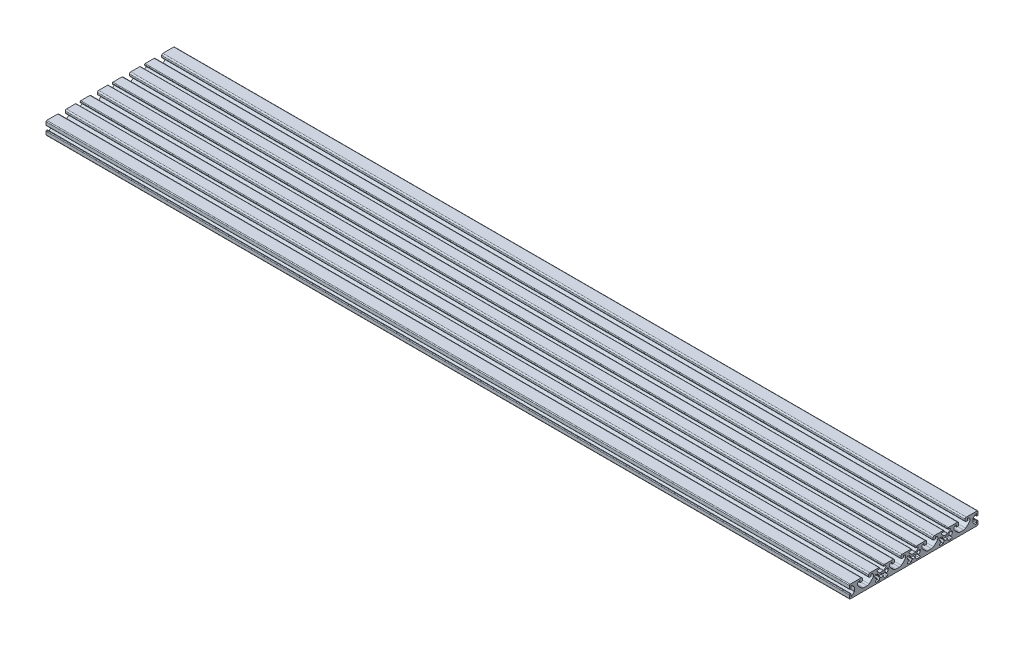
from build123d import *

# Parameters (mm, degrees)
STRUKTURBAUTEIL1_DEPTH = 1000


with BuildPart() as part:
    # Model → Strukturbauteil1 (new body)
    with BuildSketch(Plane(origin=(0, 0, 0), x_dir=(0, 0, -1), z_dir=(1, 0, 0))):
        with BuildLine():
            Line((50, 2.720360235), (50, 3.5))
            ThreePointArc((50, 3.5), (50.732233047, 5.267766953), (52.5, 6))
            ThreePointArc((52.5, 6), (52.853553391, 5.853553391), (53, 5.5))
            Line((53, 5.5), (53, 4))
            ThreePointArc((53, 4), (53.146446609, 3.646446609), (53.5, 3.5))
            Line((53.5, 3.5), (55, 3.5))
            ThreePointArc((55, 3.5), (55.707106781, 3.792893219), (56, 4.5))
            Line((56, 4.5), (56, 6.5))
            ThreePointArc((56, 6.5), (55.560660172, 7.560660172), (54.5, 8))
            Line((54.5, 8), (43.3, 8))
            ThreePointArc((43.3, 8), (42.734314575, 7.765685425), (42.5, 7.2))
            Line((42.5, 7.2), (42.5, 6.5))
            ThreePointArc((42.5, 6.5), (42.587867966, 6.287867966), (42.8, 6.2))
            Line((42.8, 6.2), (44.95, 6.2))
            ThreePointArc((44.95, 6.2), (45.689103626, 5.706146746), (45.515685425, 4.834314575))
            Line((45.515685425, 4.834314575), (42.715685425, 2.034314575))
            ThreePointArc((42.715685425, 2.034314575), (42.456146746, 1.860896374), (42.15, 1.8))
            Line((42.15, 1.8), (37.85, 1.8))
            ThreePointArc((37.85, 1.8), (37.543853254, 1.860896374), (37.284314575, 2.034314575))
            Line((37.284314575, 2.034314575), (34.484314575, 4.834314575))
            ThreePointArc((34.484314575, 4.834314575), (34.310896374, 5.706146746), (35.05, 6.2))
            Line((35.05, 6.2), (37.2, 6.2))
            ThreePointArc((37.2, 6.2), (37.412132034, 6.287867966), (37.5, 6.5))
            Line((37.5, 6.5), (37.5, 7.2))
            ThreePointArc((37.5, 7.2), (37.265685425, 7.765685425), (36.7, 8))
            Line((36.7, 8), (25.5, 8))
            ThreePointArc((25.5, 8), (24.439339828, 7.560660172), (24, 6.5))
            Line((24, 6.5), (24, 4.5))
            ThreePointArc((24, 4.5), (24.292893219, 3.792893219), (25, 3.5))
            Line((25, 3.5), (26.5, 3.5))
            ThreePointArc((26.5, 3.5), (26.853553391, 3.646446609), (27, 4))
            Line((27, 4), (27, 5.5))
            ThreePointArc((27, 5.5), (27.146446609, 5.853553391), (27.5, 6))
            ThreePointArc((27.5, 6), (29.267766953, 5.267766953), (30, 3.5))
            Line((30, 3.5), (30, 2.720360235))
            ThreePointArc((30, 2.720360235), (29.895991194, 2.083793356), (29.594782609, 1.513435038))
            ThreePointArc((29.594782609, 1.513435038), (27.264029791, -1.151003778), (24.580305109, -3.45952381))
            ThreePointArc((24.580305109, -3.45952381), (23.45041558, -4.047242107), (22.193056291, -4.25))
            Line((22.193056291, -4.25), (20, -4.25))
            Line((20, -4.25), (17.806943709, -4.25))
            ThreePointArc((17.806943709, -4.25), (16.54958442, -4.047242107), (15.419694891, -3.45952381))
            ThreePointArc((15.419694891, -3.45952381), (12.735970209, -1.151003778), (10.405217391, 1.513435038))
            ThreePointArc((10.405217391, 1.513435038), (10.104008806, 2.083793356), (10, 2.720360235))
            Line((10, 2.720360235), (10, 3.5))
            ThreePointArc((10, 3.5), (10.732233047, 5.267766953), (12.5, 6))
            ThreePointArc((12.5, 6), (12.853553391, 5.853553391), (13, 5.5))
            Line((13, 5.5), (13, 4))
            ThreePointArc((13, 4), (13.146446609, 3.646446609), (13.5, 3.5))
            Line((13.5, 3.5), (15, 3.5))
            ThreePointArc((15, 3.5), (15.707106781, 3.792893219), (16, 4.5))
            Line((16, 4.5), (16, 6.5))
            ThreePointArc((16, 6.5), (15.560660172, 7.560660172), (14.5, 8))
            Line((14.5, 8), (3.3, 8))
            ThreePointArc((3.3, 8), (2.734314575, 7.765685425), (2.5, 7.2))
            Line((2.5, 7.2), (2.5, 6.5))
            ThreePointArc((2.5, 6.5), (2.587867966, 6.287867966), (2.8, 6.2))
            Line((2.8, 6.2), (4.95, 6.2))
            ThreePointArc((4.95, 6.2), (5.689103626, 5.706146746), (5.515685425, 4.834314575))
            Line((5.515685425, 4.834314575), (2.715685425, 2.034314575))
            ThreePointArc((2.715685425, 2.034314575), (2.456146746, 1.860896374), (2.15, 1.8))
            Line((2.15, 1.8), (-2.15, 1.8))
            ThreePointArc((-2.15, 1.8), (-2.456146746, 1.860896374), (-2.715685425, 2.034314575))
            Line((-2.715685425, 2.034314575), (-5.515685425, 4.834314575))
            ThreePointArc((-5.515685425, 4.834314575), (-5.689103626, 5.706146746), (-4.95, 6.2))
            Line((-4.95, 6.2), (-2.8, 6.2))
            ThreePointArc((-2.8, 6.2), (-2.587867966, 6.287867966), (-2.5, 6.5))
            Line((-2.5, 6.5), (-2.5, 7.2))
            ThreePointArc((-2.5, 7.2), (-2.734314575, 7.765685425), (-3.3, 8))
            Line((-3.3, 8), (-14.5, 8))
            ThreePointArc((-14.5, 8), (-15.560660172, 7.560660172), (-16, 6.5))
            Line((-16, 6.5), (-16, 4.5))
            ThreePointArc((-16, 4.5), (-15.707106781, 3.792893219), (-15, 3.5))
            Line((-15, 3.5), (-13.5, 3.5))
            ThreePointArc((-13.5, 3.5), (-13.146446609, 3.646446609), (-13, 4))
            Line((-13, 4), (-13, 5.5))
            ThreePointArc((-13, 5.5), (-12.853553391, 5.853553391), (-12.5, 6))
            ThreePointArc((-12.5, 6), (-10.732233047, 5.267766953), (-10, 3.5))
            Line((-10, 3.5), (-10, 2.720360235))
            ThreePointArc((-10, 2.720360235), (-10.104008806, 2.083793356), (-10.405217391, 1.513435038))
            ThreePointArc((-10.405217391, 1.513435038), (-12.735970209, -1.151003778), (-15.419694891, -3.45952381))
            ThreePointArc((-15.419694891, -3.45952381), (-16.54958442, -4.047242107), (-17.806943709, -4.25))
            Line((-17.806943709, -4.25), (-20, -4.25))
            Line((-20, -4.25), (-22.193056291, -4.25))
            ThreePointArc((-22.193056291, -4.25), (-23.45041558, -4.047242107), (-24.580305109, -3.45952381))
            ThreePointArc((-24.580305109, -3.45952381), (-27.264029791, -1.151003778), (-29.594782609, 1.513435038))
            ThreePointArc((-29.594782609, 1.513435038), (-29.895991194, 2.083793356), (-30, 2.720360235))
            Line((-30, 2.720360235), (-30, 3.5))
            ThreePointArc((-30, 3.5), (-29.267766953, 5.267766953), (-27.5, 6))
            ThreePointArc((-27.5, 6), (-27.146446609, 5.853553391), (-27, 5.5))
            Line((-27, 5.5), (-27, 4))
            ThreePointArc((-27, 4), (-26.853553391, 3.646446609), (-26.5, 3.5))
            Line((-26.5, 3.5), (-25, 3.5))
            ThreePointArc((-25, 3.5), (-24.292893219, 3.792893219), (-24, 4.5))
            Line((-24, 4.5), (-24, 6.5))
            ThreePointArc((-24, 6.5), (-24.439339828, 7.560660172), (-25.5, 8))
            Line((-25.5, 8), (-36.7, 8))
            ThreePointArc((-36.7, 8), (-37.265685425, 7.765685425), (-37.5, 7.2))
            Line((-37.5, 7.2), (-37.5, 6.5))
            ThreePointArc((-37.5, 6.5), (-37.412132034, 6.287867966), (-37.2, 6.2))
            Line((-37.2, 6.2), (-35.05, 6.2))
            ThreePointArc((-35.05, 6.2), (-34.310896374, 5.706146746), (-34.484314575, 4.834314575))
            Line((-34.484314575, 4.834314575), (-37.284314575, 2.034314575))
            ThreePointArc((-37.284314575, 2.034314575), (-37.543853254, 1.860896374), (-37.85, 1.8))
            Line((-37.85, 1.8), (-42.15, 1.8))
            ThreePointArc((-42.15, 1.8), (-42.456146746, 1.860896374), (-42.715685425, 2.034314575))
            Line((-42.715685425, 2.034314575), (-45.515685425, 4.834314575))
            ThreePointArc((-45.515685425, 4.834314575), (-45.689103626, 5.706146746), (-44.95, 6.2))
            Line((-44.95, 6.2), (-42.8, 6.2))
            ThreePointArc((-42.8, 6.2), (-42.587867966, 6.287867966), (-42.5, 6.5))
            Line((-42.5, 6.5), (-42.5, 7.2))
            ThreePointArc((-42.5, 7.2), (-42.734314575, 7.765685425), (-43.3, 8))
            Line((-43.3, 8), (-54.5, 8))
            ThreePointArc((-54.5, 8), (-55.560660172, 7.560660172), (-56, 6.5))
            Line((-56, 6.5), (-56, 4.5))
            ThreePointArc((-56, 4.5), (-55.707106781, 3.792893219), (-55, 3.5))
            Line((-55, 3.5), (-53.5, 3.5))
            ThreePointArc((-53.5, 3.5), (-53.146446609, 3.646446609), (-53, 4))
            Line((-53, 4), (-53, 5.5))
            ThreePointArc((-53, 5.5), (-52.853553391, 5.853553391), (-52.5, 6))
            ThreePointArc((-52.5, 6), (-50.732233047, 5.267766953), (-50, 3.5))
            Line((-50, 3.5), (-50, 2.720360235))
            ThreePointArc((-50, 2.720360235), (-50.104008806, 2.083793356), (-50.405217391, 1.513435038))
            ThreePointArc((-50.405217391, 1.513435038), (-52.735970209, -1.151003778), (-55.419694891, -3.45952381))
            ThreePointArc((-55.419694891, -3.45952381), (-56.54958442, -4.047242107), (-57.806943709, -4.25))
            Line((-57.806943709, -4.25), (-60, -4.25))
            Line((-60, -4.25), (-62.193056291, -4.25))
            ThreePointArc((-62.193056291, -4.25), (-63.45041558, -4.047242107), (-64.580305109, -3.45952381))
            ThreePointArc((-64.580305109, -3.45952381), (-67.264029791, -1.151003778), (-69.594782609, 1.513435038))
            ThreePointArc((-69.594782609, 1.513435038), (-69.895991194, 2.083793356), (-70, 2.720360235))
            Line((-70, 2.720360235), (-70, 3.5))
            ThreePointArc((-70, 3.5), (-69.267766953, 5.267766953), (-67.5, 6))
            ThreePointArc((-67.5, 6), (-67.146446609, 5.853553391), (-67, 5.5))
            Line((-67, 5.5), (-67, 4))
            ThreePointArc((-67, 4), (-66.853553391, 3.646446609), (-66.5, 3.5))
            Line((-66.5, 3.5), (-65, 3.5))
            ThreePointArc((-65, 3.5), (-64.292893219, 3.792893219), (-64, 4.5))
            Line((-64, 4.5), (-64, 6.5))
            ThreePointArc((-64, 6.5), (-64.439339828, 7.560660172), (-65.5, 8))
            Line((-65.5, 8), (-79, 8))
            ThreePointArc((-79, 8), (-79.707106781, 7.707106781), (-80, 7))
            Line((-80, 7), (-80, 3.3))
            ThreePointArc((-80, 3.3), (-79.765685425, 2.734314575), (-79.2, 2.5))
            Line((-79.2, 2.5), (-78.5, 2.5))
            ThreePointArc((-78.5, 2.5), (-78.287867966, 2.587867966), (-78.2, 2.8))
            Line((-78.2, 2.8), (-78.2, 4.95))
            ThreePointArc((-78.2, 4.95), (-77.706146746, 5.689103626), (-76.834314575, 5.515685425))
            Line((-76.834314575, 5.515685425), (-74.034314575, 2.715685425))
            ThreePointArc((-74.034314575, 2.715685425), (-73.860896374, 2.456146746), (-73.8, 2.15))
            Line((-73.8, 2.15), (-73.8, -2.15))
            ThreePointArc((-73.8, -2.15), (-73.860896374, -2.456146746), (-74.034314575, -2.715685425))
            Line((-74.034314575, -2.715685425), (-76.834314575, -5.515685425))
            ThreePointArc((-76.834314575, -5.515685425), (-77.706146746, -5.689103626), (-78.2, -4.95))
            Line((-78.2, -4.95), (-78.2, -2.8))
            ThreePointArc((-78.2, -2.8), (-78.287867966, -2.587867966), (-78.5, -2.5))
            Line((-78.5, -2.5), (-79.2, -2.5))
            ThreePointArc((-79.2, -2.5), (-79.765685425, -2.734314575), (-80, -3.3))
            Line((-80, -3.3), (-80, -7))
            ThreePointArc((-80, -7), (-79.707106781, -7.707106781), (-79, -8))
            Line((-79, -8), (79, -8))
            ThreePointArc((79, -8), (79.707106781, -7.707106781), (80, -7))
            Line((80, -7), (80, -3.3))
            ThreePointArc((80, -3.3), (79.765685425, -2.734314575), (79.2, -2.5))
            Line((79.2, -2.5), (78.5, -2.5))
            ThreePointArc((78.5, -2.5), (78.287867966, -2.587867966), (78.2, -2.8))
            Line((78.2, -2.8), (78.2, -4.95))
            ThreePointArc((78.2, -4.95), (77.706146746, -5.689103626), (76.834314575, -5.515685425))
            Line((76.834314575, -5.515685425), (74.034314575, -2.715685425))
            ThreePointArc((74.034314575, -2.715685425), (73.860896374, -2.456146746), (73.8, -2.15))
            Line((73.8, -2.15), (73.8, 2.15))
            ThreePointArc((73.8, 2.15), (73.860896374, 2.456146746), (74.034314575, 2.715685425))
            Line((74.034314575, 2.715685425), (76.834314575, 5.515685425))
            ThreePointArc((76.834314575, 5.515685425), (77.706146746, 5.689103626), (78.2, 4.95))
            Line((78.2, 4.95), (78.2, 2.8))
            ThreePointArc((78.2, 2.8), (78.287867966, 2.587867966), (78.5, 2.5))
            Line((78.5, 2.5), (79.2, 2.5))
            ThreePointArc((79.2, 2.5), (79.765685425, 2.734314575), (80, 3.3))
            Line((80, 3.3), (80, 7))
            ThreePointArc((80, 7), (79.707106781, 7.707106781), (79, 8))
            Line((79, 8), (65.5, 8))
            ThreePointArc((65.5, 8), (64.439339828, 7.560660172), (64, 6.5))
            Line((64, 6.5), (64, 4.5))
            ThreePointArc((64, 4.5), (64.292893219, 3.792893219), (65, 3.5))
            Line((65, 3.5), (66.5, 3.5))
            ThreePointArc((66.5, 3.5), (66.853553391, 3.646446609), (67, 4))
            Line((67, 4), (67, 5.5))
            ThreePointArc((67, 5.5), (67.146446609, 5.853553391), (67.5, 6))
            ThreePointArc((67.5, 6), (69.267766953, 5.267766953), (70, 3.5))
            Line((70, 3.5), (70, 2.720360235))
            ThreePointArc((70, 2.720360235), (69.895991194, 2.083793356), (69.594782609, 1.513435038))
            ThreePointArc((69.594782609, 1.513435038), (67.264029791, -1.151003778), (64.580305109, -3.45952381))
            ThreePointArc((64.580305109, -3.45952381), (63.45041558, -4.047242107), (62.193056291, -4.25))
            Line((62.193056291, -4.25), (60, -4.25))
            Line((60, -4.25), (57.806943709, -4.25))
            ThreePointArc((57.806943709, -4.25), (56.54958442, -4.047242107), (55.419694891, -3.45952381))
            ThreePointArc((55.419694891, -3.45952381), (52.735970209, -1.151003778), (50.405217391, 1.513435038))
            ThreePointArc((50.405217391, 1.513435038), (50.104008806, 2.083793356), (50, 2.720360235))
        make_face()
        with BuildLine():
            Line((-48.474873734, 1.060660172), (-47.931851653, 0.51763809))
            ThreePointArc((-47.931851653, 0.51763809), (-47.586706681, -1.217522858), (-46, -2))
            Line((-46, -2), (-46, -3))
            Line((-46, -3), (-47.492893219, -4.492893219))
            ThreePointArc((-47.492893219, -4.492893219), (-47.70966597, -5.582683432), (-46.785786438, -6.2))
            Line((-46.785786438, -6.2), (-43, -6.2))
            Line((-43, -6.2), (-42.197898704, -3.206517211))
            ThreePointArc((-42.197898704, -3.206517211), (-41.957481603, -2.988251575), (-41.659235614, -3.116663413))
            ThreePointArc((-41.659235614, -3.116663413), (-40, -4), (-38.340764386, -3.116663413))
            ThreePointArc((-38.340764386, -3.116663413), (-38.042518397, -2.988251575), (-37.802101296, -3.206517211))
            Line((-37.802101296, -3.206517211), (-37, -6.2))
            Line((-37, -6.2), (-33.214213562, -6.2))
            ThreePointArc((-33.214213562, -6.2), (-32.29033403, -5.582683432), (-32.507106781, -4.492893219))
            Line((-32.507106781, -4.492893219), (-34, -3))
            Line((-34, -3), (-34, -2))
            ThreePointArc((-34, -2), (-32.413293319, -1.217522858), (-32.068148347, 0.51763809))
            Line((-32.068148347, 0.51763809), (-31.525126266, 1.060660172))
            ThreePointArc((-31.525126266, 1.060660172), (-31.466547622, 1.202081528), (-31.525126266, 1.343502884))
            Line((-31.525126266, 1.343502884), (-32.656497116, 2.474873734))
            ThreePointArc((-32.656497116, 2.474873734), (-32.797918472, 2.533452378), (-32.939339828, 2.474873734))
            Line((-32.939339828, 2.474873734), (-33.48236191, 1.931851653))
            ThreePointArc((-33.48236191, 1.931851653), (-35.414211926, 1.414215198), (-35.93185285, -0.517633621))
            Line((-35.93185285, -0.517633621), (-36.41421783, -1))
            Line((-36.41421783, -1), (-38.267949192, -1))
            ThreePointArc((-38.267949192, -1), (-40, 0), (-41.732050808, -1))
            Line((-41.732050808, -1), (-43.58578217, -1))
            Line((-43.58578217, -1), (-44.06814715, -0.517633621))
            ThreePointArc((-44.06814715, -0.517633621), (-44.585788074, 1.414215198), (-46.51763809, 1.931851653))
            Line((-46.51763809, 1.931851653), (-47.060660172, 2.474873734))
            ThreePointArc((-47.060660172, 2.474873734), (-47.202081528, 2.533452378), (-47.343502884, 2.474873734))
            Line((-47.343502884, 2.474873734), (-48.474873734, 1.343502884))
            ThreePointArc((-48.474873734, 1.343502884), (-48.533452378, 1.202081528), (-48.474873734, 1.060660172))
        make_face(mode=Mode.SUBTRACT)
        with BuildLine():
            Line((-6, -2), (-6, -3))
            Line((-6, -3), (-7.492893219, -4.492893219))
            ThreePointArc((-7.492893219, -4.492893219), (-7.70966597, -5.582683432), (-6.785786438, -6.2))
            Line((-6.785786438, -6.2), (-3, -6.2))
            Line((-3, -6.2), (-2.197898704, -3.206517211))
            ThreePointArc((-2.197898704, -3.206517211), (-1.957481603, -2.988251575), (-1.659235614, -3.116663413))
            ThreePointArc((-1.659235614, -3.116663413), (0, -4), (1.659235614, -3.116663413))
            ThreePointArc((1.659235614, -3.116663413), (1.957481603, -2.988251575), (2.197898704, -3.206517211))
            Line((2.197898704, -3.206517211), (3, -6.2))
            Line((3, -6.2), (6.785786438, -6.2))
            ThreePointArc((6.785786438, -6.2), (7.70966597, -5.582683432), (7.492893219, -4.492893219))
            Line((7.492893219, -4.492893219), (6, -3))
            Line((6, -3), (6, -2))
            ThreePointArc((6, -2), (7.586706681, -1.217522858), (7.931851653, 0.51763809))
            Line((7.931851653, 0.51763809), (8.474873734, 1.060660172))
            ThreePointArc((8.474873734, 1.060660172), (8.533452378, 1.202081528), (8.474873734, 1.343502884))
            Line((8.474873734, 1.343502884), (7.343502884, 2.474873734))
            ThreePointArc((7.343502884, 2.474873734), (7.202081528, 2.533452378), (7.060660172, 2.474873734))
            Line((7.060660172, 2.474873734), (6.51763809, 1.931851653))
            ThreePointArc((6.51763809, 1.931851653), (4.585788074, 1.414215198), (4.06814715, -0.517633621))
            Line((4.06814715, -0.517633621), (3.58578217, -1))
            Line((3.58578217, -1), (1.732050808, -1))
            ThreePointArc((1.732050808, -1), (0, 0), (-1.732050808, -1))
            Line((-1.732050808, -1), (-3.58578217, -1))
            Line((-3.58578217, -1), (-4.06814715, -0.517633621))
            ThreePointArc((-4.06814715, -0.517633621), (-4.585788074, 1.414215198), (-6.51763809, 1.931851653))
            Line((-6.51763809, 1.931851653), (-7.060660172, 2.474873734))
            ThreePointArc((-7.060660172, 2.474873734), (-7.202081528, 2.533452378), (-7.343502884, 2.474873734))
            Line((-7.343502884, 2.474873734), (-8.474873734, 1.343502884))
            ThreePointArc((-8.474873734, 1.343502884), (-8.533452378, 1.202081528), (-8.474873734, 1.060660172))
            Line((-8.474873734, 1.060660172), (-7.931851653, 0.51763809))
            ThreePointArc((-7.931851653, 0.51763809), (-7.586706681, -1.217522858), (-6, -2))
        make_face(mode=Mode.SUBTRACT)
        with BuildLine():
            Line((34, -2), (34, -3))
            Line((34, -3), (32.507106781, -4.492893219))
            ThreePointArc((32.507106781, -4.492893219), (32.29033403, -5.582683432), (33.214213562, -6.2))
            Line((33.214213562, -6.2), (37, -6.2))
            Line((37, -6.2), (37.802101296, -3.206517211))
            ThreePointArc((37.802101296, -3.206517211), (38.042518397, -2.988251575), (38.340764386, -3.116663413))
            ThreePointArc((38.340764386, -3.116663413), (40, -4), (41.659235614, -3.116663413))
            ThreePointArc((41.659235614, -3.116663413), (41.957481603, -2.988251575), (42.197898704, -3.206517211))
            Line((42.197898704, -3.206517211), (43, -6.2))
            Line((43, -6.2), (46.785786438, -6.2))
            ThreePointArc((46.785786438, -6.2), (47.70966597, -5.582683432), (47.492893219, -4.492893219))
            Line((47.492893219, -4.492893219), (46, -3))
            Line((46, -3), (46, -2))
            ThreePointArc((46, -2), (47.586706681, -1.217522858), (47.931851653, 0.51763809))
            Line((47.931851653, 0.51763809), (48.474873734, 1.060660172))
            ThreePointArc((48.474873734, 1.060660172), (48.533452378, 1.202081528), (48.474873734, 1.343502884))
            Line((48.474873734, 1.343502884), (47.343502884, 2.474873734))
            ThreePointArc((47.343502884, 2.474873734), (47.202081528, 2.533452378), (47.060660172, 2.474873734))
            Line((47.060660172, 2.474873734), (46.51763809, 1.931851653))
            ThreePointArc((46.51763809, 1.931851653), (44.585788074, 1.414215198), (44.06814715, -0.517633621))
            Line((44.06814715, -0.517633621), (43.58578217, -1))
            Line((43.58578217, -1), (41.732050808, -1))
            ThreePointArc((41.732050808, -1), (40, 0), (38.267949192, -1))
            Line((38.267949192, -1), (36.41421783, -1))
            Line((36.41421783, -1), (35.93185285, -0.517633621))
            ThreePointArc((35.93185285, -0.517633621), (35.414211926, 1.414215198), (33.48236191, 1.931851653))
            Line((33.48236191, 1.931851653), (32.939339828, 2.474873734))
            ThreePointArc((32.939339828, 2.474873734), (32.797918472, 2.533452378), (32.656497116, 2.474873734))
            Line((32.656497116, 2.474873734), (31.525126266, 1.343502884))
            ThreePointArc((31.525126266, 1.343502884), (31.466547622, 1.202081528), (31.525126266, 1.060660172))
            Line((31.525126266, 1.060660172), (32.068148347, 0.51763809))
            ThreePointArc((32.068148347, 0.51763809), (32.413293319, -1.217522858), (34, -2))
        make_face(mode=Mode.SUBTRACT)
    extrude(amount=STRUKTURBAUTEIL1_DEPTH)


solid = part.part
